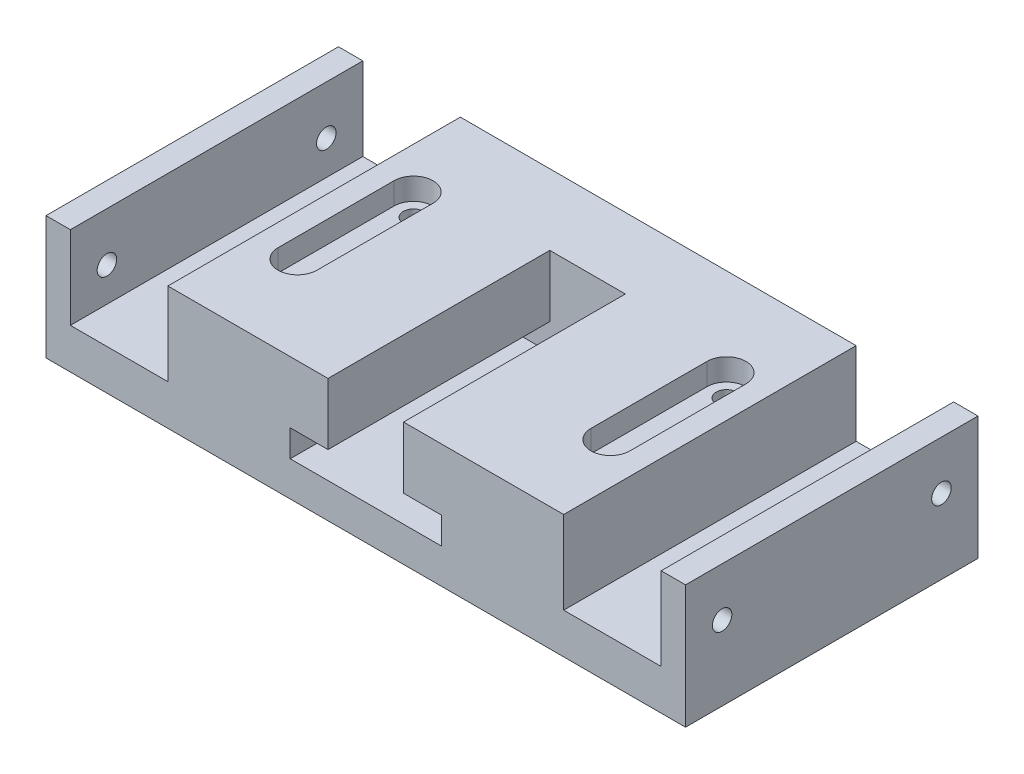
from build123d import *

# Parameters (mm, degrees)
SKETCH_1_W          = 131.2
SKETCH_1_H          = 25.3
EXTRUDE_1_DEPTH     = 60
CUT_EXTRUDE_1_DEPTH = 45.5
SKETCH_5_R          = 2.1
CUT_EXTRUDE_2_DEPTH = 45.5
CUT_EXTRUDE_3_DEPTH = 4.5
SKETCH_7_W          = 20
SKETCH_7_H          = 17
CUT_EXTRUDE_4_DEPTH = 90.796339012
CUT_EXTRUDE_5_REACH = 146.822
SKETCH_8_R          = 2
CUT_EXTRUDE_6_REACH = 146.822
SKETCH_9_R          = 2
SKETCH_10_R         = 3.5
CUT_EXTRUDE_7_DEPTH = 4


with BuildPart() as part:
    # Sketch 1 → Extrude 1 (new body)
    with BuildSketch(Plane.XY):
        Rectangle(SKETCH_1_W, SKETCH_1_H)
    extrude(amount=EXTRUDE_1_DEPTH)

    # Sketch 4 → Cut-Extrude 1 (cut)
    with BuildSketch(Plane.XY.offset(60)):
        Polygon((7.75, 12.65), (-7.75, 12.65), (-7.75, 0), (-15.5, 0), (-15.5, -5.5), (15.5, -5.5), (15.5, 0), (7.75, 0), align=None)
    extrude(amount=-CUT_EXTRUDE_1_DEPTH, mode=Mode.SUBTRACT)

    # Sketch 5 → Cut-Extrude 2 (cut)
    with BuildSketch(Plane(origin=(0, 12.65, 0), x_dir=(1, 0, 0), z_dir=(0, 1, 0))):
        with Locations(Location((-32.1, -18.1, 0), (0, 0, 270))):
            Circle(SKETCH_5_R)
        with Locations(Location((32.1, -18.1, 0), (0, 0, 270))):
            Circle(SKETCH_5_R)
        with Locations(Location((-32.1, -41.9, 0), (0, 0, 270))):
            Circle(SKETCH_5_R)
        with Locations(Location((32.1, -41.9, 0), (0, 0, 270))):
            Circle(SKETCH_5_R)
    extrude(amount=-CUT_EXTRUDE_2_DEPTH, mode=Mode.SUBTRACT)

    # Sketch 6 → Cut-Extrude 3 (cut)
    with BuildSketch(Plane(origin=(0, 12.65, 0), x_dir=(1, 0, 0), z_dir=(0, 1, 0))):
        with BuildLine():
            Line((-28.1, -41.9), (-28.1, -18.1))
            ThreePointArc((-28.1, -18.1), (-32.1, -14.1), (-36.1, -18.1))
            Line((-36.1, -18.1), (-36.1, -41.9))
            ThreePointArc((-36.1, -41.9), (-32.1, -45.9), (-28.1, -41.9))
        make_face()
        with BuildLine():
            Line((36.1, -18.1), (36.1, -41.9))
            ThreePointArc((36.1, -41.9), (32.1, -45.9), (28.1, -41.9))
            Line((28.1, -41.9), (28.1, -18.1))
            ThreePointArc((28.1, -18.1), (32.1, -14.1), (36.1, -18.1))
        make_face()
    extrude(amount=-CUT_EXTRUDE_3_DEPTH, mode=Mode.SUBTRACT)

    # Sketch 7 → Cut-Extrude 4 (cut, through all)
    with BuildSketch(Plane.XY.offset(60)):
        with Locations((-50.6, 4.15)):
            Rectangle(SKETCH_7_W, SKETCH_7_H)
        with Locations((50.6, 4.15)):
            Rectangle(SKETCH_7_W, SKETCH_7_H)
    extrude(amount=-CUT_EXTRUDE_4_DEPTH, mode=Mode.SUBTRACT)

    # Sketch 8 → Cut-Extrude 5 (cut, up to next)
    with BuildSketch(Plane.ZY.offset(65.6), mode=Mode.PRIVATE) as cut_extrude_5_sk1:
        with Locations((52.5, 2.65)):
            Circle(SKETCH_8_R)
    cut_extrude_5_tool1 = extrude(cut_extrude_5_sk1.sketch, amount=-CUT_EXTRUDE_5_REACH, mode=Mode.PRIVATE) & part.part
    # Sketch 8 → Cut-Extrude 5 (cut, up to next)
    with BuildSketch(Plane.ZY.offset(65.6), mode=Mode.PRIVATE) as cut_extrude_5_sk2:
        with Locations(Location((7.5, 2.65, 0), (0, 0, 270))):
            Circle(SKETCH_8_R)
    cut_extrude_5_tool2 = extrude(cut_extrude_5_sk2.sketch, amount=-CUT_EXTRUDE_5_REACH, mode=Mode.PRIVATE) & part.part
    add(cut_extrude_5_tool1.solids().sort_by_distance((-65.6, 2.65, 52.5))[0], mode=Mode.SUBTRACT)
    add(cut_extrude_5_tool2.solids().sort_by_distance((-65.6, 2.65, 7.5))[0], mode=Mode.SUBTRACT)

    # Sketch 9 → Cut-Extrude 6 (cut, up to next)
    with BuildSketch(Plane(origin=(65.6, 0, 0), x_dir=(0, 0, -1), z_dir=(1, 0, 0)), mode=Mode.PRIVATE) as cut_extrude_6_sk1:
        with Locations(Location((-7.5, 2.65, 0), (0, 0, 270))):
            Circle(SKETCH_9_R)
    cut_extrude_6_tool1 = extrude(cut_extrude_6_sk1.sketch, amount=-CUT_EXTRUDE_6_REACH, mode=Mode.PRIVATE) & part.part
    # Sketch 9 → Cut-Extrude 6 (cut, up to next)
    with BuildSketch(Plane(origin=(65.6, 0, 0), x_dir=(0, 0, -1), z_dir=(1, 0, 0)), mode=Mode.PRIVATE) as cut_extrude_6_sk2:
        with Locations(Location((-52.5, 2.65, 0), (0, 0, 180))):
            Circle(SKETCH_9_R)
    cut_extrude_6_tool2 = extrude(cut_extrude_6_sk2.sketch, amount=-CUT_EXTRUDE_6_REACH, mode=Mode.PRIVATE) & part.part
    add(cut_extrude_6_tool1.solids().sort_by_distance((65.6, 2.65, 7.5))[0], mode=Mode.SUBTRACT)
    add(cut_extrude_6_tool2.solids().sort_by_distance((65.6, 2.65, 52.5))[0], mode=Mode.SUBTRACT)

    # Sketch 10 → Cut-Extrude 7 (cut)
    with BuildSketch(Plane.XZ.offset(12.65)):
        with Locations(Location((-32.1, 10.6, 0), (0, 0, 270))):
            Circle(SKETCH_10_R)
        with Locations(Location((32.1, 10.6, 0), (0, 0, 90))):
            Circle(SKETCH_10_R)
        with Locations(Location((32.1, 49.4, 0), (0, 0, 270))):
            Circle(SKETCH_10_R)
        with Locations(Location((-32.1, 47.9, 0), (0, 0, 270))):
            Circle(SKETCH_10_R)
    extrude(amount=-CUT_EXTRUDE_7_DEPTH, mode=Mode.SUBTRACT)


solid = part.part
